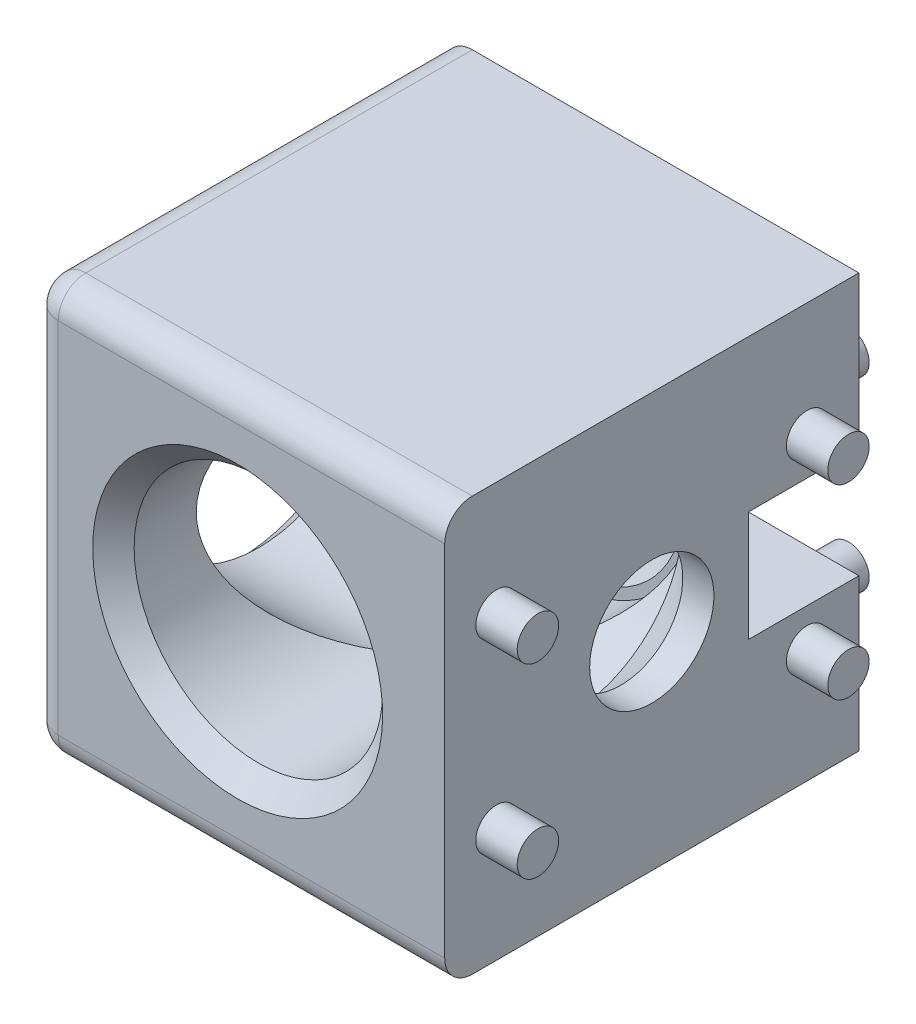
ISO-10303-21;
HEADER;
FILE_DESCRIPTION(('STEP AP214'),'2;1');
FILE_NAME('part.step','',(''),(''),'','','');
FILE_SCHEMA(('AUTOMOTIVE_DESIGN { 1 0 10303 214 1 1 1 1 }'));
ENDSEC;
DATA;
#1=APPLICATION_CONTEXT('core data for automotive mechanical design processes');
#2=APPLICATION_PROTOCOL_DEFINITION('international standard','automotive_design',2000,#1);
#3=PRODUCT_CONTEXT('',#1,'mechanical');
#4=PRODUCT('Part','Part','',(#3));
#5=PRODUCT_RELATED_PRODUCT_CATEGORY('part','',(#4));
#6=PRODUCT_DEFINITION_FORMATION('','',#4);
#7=PRODUCT_DEFINITION_CONTEXT('part definition',#1,'design');
#8=PRODUCT_DEFINITION('design','',#6,#7);
#9=PRODUCT_DEFINITION_SHAPE('','',#8);
#10=(LENGTH_UNIT() NAMED_UNIT(*) SI_UNIT(.MILLI.,.METRE.));
#11=(NAMED_UNIT(*) PLANE_ANGLE_UNIT() SI_UNIT($,.RADIAN.));
#12=(NAMED_UNIT(*) SI_UNIT($,.STERADIAN.) SOLID_ANGLE_UNIT());
#13=UNCERTAINTY_MEASURE_WITH_UNIT(LENGTH_MEASURE(1.E-05),#10,'distance_accuracy_value','');
#14=(GEOMETRIC_REPRESENTATION_CONTEXT(3) GLOBAL_UNCERTAINTY_ASSIGNED_CONTEXT((#13)) GLOBAL_UNIT_ASSIGNED_CONTEXT((#10,
#11,#12)) REPRESENTATION_CONTEXT('',''));
#15=CARTESIAN_POINT('',(0.,0.,0.));
#16=DIRECTION('',(0.,0.,1.));
#17=DIRECTION('',(1.,0.,0.));
#18=AXIS2_PLACEMENT_3D('',#15,#16,#17);
#19=CARTESIAN_POINT('',(0.,0.,6.));
#20=DIRECTION('',(0.,0.,1.));
#21=DIRECTION('',(1.,0.,0.));
#22=AXIS2_PLACEMENT_3D('',#19,#20,#21);
#23=CYLINDRICAL_SURFACE('',#22,9.);
#24=CARTESIAN_POINT('',(0.,0.,6.));
#25=DIRECTION('',(0.,0.,1.));
#26=DIRECTION('',(1.,0.,0.));
#27=AXIS2_PLACEMENT_3D('',#24,#25,#26);
#28=CIRCLE('',#27,9.);
#29=CARTESIAN_POINT('',(-9.,0.,6.));
#30=VERTEX_POINT('',#29);
#31=CARTESIAN_POINT('',(9.,0.,6.));
#32=VERTEX_POINT('',#31);
#33=EDGE_CURVE('E155',#30,#32,#28,.T.);
#34=ORIENTED_EDGE('',*,*,#33,.F.);
#35=CARTESIAN_POINT('',(0.,0.,15.));
#36=DIRECTION('',(-0.707106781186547,0.,0.707106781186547));
#37=DIRECTION('',(0.707106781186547,0.,0.707106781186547));
#38=AXIS2_PLACEMENT_3D('',#35,#36,#37);
#39=ELLIPSE('',#38,12.7279220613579,9.);
#40=CARTESIAN_POINT('',(0.,-9.,15.));
#41=VERTEX_POINT('',#40);
#42=EDGE_CURVE('E127',#30,#41,#39,.T.);
#43=ORIENTED_EDGE('',*,*,#42,.T.);
#44=CARTESIAN_POINT('',(0.,0.,15.));
#45=DIRECTION('',(0.707106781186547,0.,0.707106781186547));
#46=DIRECTION('',(-0.707106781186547,0.,0.707106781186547));
#47=AXIS2_PLACEMENT_3D('',#44,#45,#46);
#48=ELLIPSE('',#47,12.7279220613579,9.);
#49=EDGE_CURVE('E21',#41,#32,#48,.T.);
#50=ORIENTED_EDGE('',*,*,#49,.T.);
#51=EDGE_LOOP('',(#34,#43,#50));
#52=FACE_BOUND('',#51,.T.);
#53=ADVANCED_FACE('F16',(#52),#23,.F.);
#54=CARTESIAN_POINT('',(0.,0.,6.));
#55=DIRECTION('',(0.,0.,1.));
#56=DIRECTION('',(1.,0.,0.));
#57=AXIS2_PLACEMENT_3D('',#54,#55,#56);
#58=CYLINDRICAL_SURFACE('',#57,9.);
#59=CARTESIAN_POINT('',(0.,0.,15.));
#60=DIRECTION('',(0.707106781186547,0.,0.707106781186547));
#61=DIRECTION('',(-0.707106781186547,0.,0.707106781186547));
#62=AXIS2_PLACEMENT_3D('',#59,#60,#61);
#63=ELLIPSE('',#62,12.7279220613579,9.);
#64=CARTESIAN_POINT('',(0.,9.,15.));
#65=VERTEX_POINT('',#64);
#66=EDGE_CURVE('E149',#32,#65,#63,.T.);
#67=ORIENTED_EDGE('',*,*,#66,.T.);
#68=CARTESIAN_POINT('',(0.,0.,15.));
#69=DIRECTION('',(-0.707106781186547,0.,0.707106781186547));
#70=DIRECTION('',(0.707106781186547,0.,0.707106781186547));
#71=AXIS2_PLACEMENT_3D('',#68,#69,#70);
#72=ELLIPSE('',#71,12.7279220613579,9.);
#73=EDGE_CURVE('E130',#65,#30,#72,.T.);
#74=ORIENTED_EDGE('',*,*,#73,.T.);
#75=CARTESIAN_POINT('',(0.,0.,6.));
#76=DIRECTION('',(0.,0.,1.));
#77=DIRECTION('',(1.,0.,0.));
#78=AXIS2_PLACEMENT_3D('',#75,#76,#77);
#79=CIRCLE('',#78,9.);
#80=EDGE_CURVE('E156',#32,#30,#79,.T.);
#81=ORIENTED_EDGE('',*,*,#80,.F.);
#82=EDGE_LOOP('',(#67,#74,#81));
#83=FACE_BOUND('',#82,.T.);
#84=ADVANCED_FACE('F165',(#83),#58,.F.);
#85=CARTESIAN_POINT('',(9.,0.,15.));
#86=DIRECTION('',(-1.,0.,0.));
#87=DIRECTION('',(0.,0.,1.));
#88=AXIS2_PLACEMENT_3D('',#85,#86,#87);
#89=CYLINDRICAL_SURFACE('',#88,9.);
#90=ORIENTED_EDGE('',*,*,#49,.F.);
#91=CARTESIAN_POINT('',(0.,0.,15.));
#92=DIRECTION('',(-0.707106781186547,0.,0.707106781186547));
#93=DIRECTION('',(-0.707106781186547,0.,-0.707106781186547));
#94=AXIS2_PLACEMENT_3D('',#91,#92,#93);
#95=ELLIPSE('',#94,12.7279220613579,9.);
#96=CARTESIAN_POINT('',(9.,0.,24.));
#97=VERTEX_POINT('',#96);
#98=EDGE_CURVE('E144',#41,#97,#95,.T.);
#99=ORIENTED_EDGE('',*,*,#98,.T.);
#100=CARTESIAN_POINT('',(9.,0.,15.));
#101=DIRECTION('',(-1.,0.,0.));
#102=DIRECTION('',(0.,0.,1.));
#103=AXIS2_PLACEMENT_3D('',#100,#101,#102);
#104=CIRCLE('',#103,9.);
#105=EDGE_CURVE('E146',#32,#97,#104,.T.);
#106=ORIENTED_EDGE('',*,*,#105,.F.);
#107=EDGE_LOOP('',(#90,#99,#106));
#108=FACE_BOUND('',#107,.T.);
#109=ADVANCED_FACE('F143',(#108),#89,.F.);
#110=CARTESIAN_POINT('',(9.,0.,15.));
#111=DIRECTION('',(-1.,0.,0.));
#112=DIRECTION('',(0.,0.,1.));
#113=AXIS2_PLACEMENT_3D('',#110,#111,#112);
#114=CYLINDRICAL_SURFACE('',#113,9.);
#115=CARTESIAN_POINT('',(9.,0.,15.));
#116=DIRECTION('',(-1.,0.,0.));
#117=DIRECTION('',(0.,0.,1.));
#118=AXIS2_PLACEMENT_3D('',#115,#116,#117);
#119=CIRCLE('',#118,9.);
#120=EDGE_CURVE('E152',#97,#32,#119,.T.);
#121=ORIENTED_EDGE('',*,*,#120,.F.);
#122=CARTESIAN_POINT('',(0.,0.,15.));
#123=DIRECTION('',(-0.707106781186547,0.,0.707106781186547));
#124=DIRECTION('',(-0.707106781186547,0.,-0.707106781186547));
#125=AXIS2_PLACEMENT_3D('',#122,#123,#124);
#126=ELLIPSE('',#125,12.7279220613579,9.);
#127=EDGE_CURVE('E137',#97,#65,#126,.T.);
#128=ORIENTED_EDGE('',*,*,#127,.T.);
#129=ORIENTED_EDGE('',*,*,#66,.F.);
#130=EDGE_LOOP('',(#121,#128,#129));
#131=FACE_BOUND('',#130,.T.);
#132=ADVANCED_FACE('F167',(#131),#114,.F.);
#133=CARTESIAN_POINT('',(0.,0.,6.));
#134=DIRECTION('',(0.,0.,1.));
#135=DIRECTION('',(1.,0.,0.));
#136=AXIS2_PLACEMENT_3D('',#133,#134,#135);
#137=PLANE('',#136);
#138=ORIENTED_EDGE('',*,*,#33,.T.);
#139=ORIENTED_EDGE('',*,*,#80,.T.);
#140=EDGE_LOOP('',(#138,#139));
#141=FACE_BOUND('',#140,.T.);
#142=CARTESIAN_POINT('',(0.,0.,6.00000000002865));
#143=DIRECTION('',(0.,0.,1.));
#144=DIRECTION('',(1.,0.,0.));
#145=AXIS2_PLACEMENT_3D('',#142,#143,#144);
#146=CIRCLE('',#145,8.25000000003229);
#147=CARTESIAN_POINT('',(8.25000000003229,0.,6.00000000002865));
#148=VERTEX_POINT('',#147);
#149=EDGE_CURVE('E136',#148,#148,#146,.F.);
#150=ORIENTED_EDGE('',*,*,#149,.T.);
#151=EDGE_LOOP('',(#150));
#152=FACE_BOUND('',#151,.T.);
#153=ADVANCED_FACE('F193',(#141,#152),#137,.T.);
#154=CARTESIAN_POINT('',(9.,0.,15.));
#155=DIRECTION('',(-1.,0.,0.));
#156=DIRECTION('',(0.,0.,1.));
#157=AXIS2_PLACEMENT_3D('',#154,#155,#156);
#158=CYLINDRICAL_SURFACE('',#157,9.);
#159=CARTESIAN_POINT('',(0.,0.,15.));
#160=DIRECTION('',(-0.707106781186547,0.,-0.707106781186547));
#161=DIRECTION('',(-0.707106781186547,0.,0.707106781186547));
#162=AXIS2_PLACEMENT_3D('',#159,#160,#161);
#163=ELLIPSE('',#162,12.7279220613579,9.);
#164=EDGE_CURVE('E122',#65,#41,#163,.F.);
#165=ORIENTED_EDGE('',*,*,#164,.T.);
#166=ORIENTED_EDGE('',*,*,#42,.F.);
#167=ORIENTED_EDGE('',*,*,#73,.F.);
#168=EDGE_LOOP('',(#165,#166,#167));
#169=FACE_BOUND('',#168,.T.);
#170=CARTESIAN_POINT('',(-13.5,0.,15.));
#171=DIRECTION('',(-1.,0.,0.));
#172=DIRECTION('',(0.,0.,1.));
#173=AXIS2_PLACEMENT_3D('',#170,#171,#172);
#174=CIRCLE('',#173,9.);
#175=CARTESIAN_POINT('',(-13.5,0.,24.));
#176=VERTEX_POINT('',#175);
#177=EDGE_CURVE('E181',#176,#176,#174,.T.);
#178=ORIENTED_EDGE('',*,*,#177,.T.);
#179=EDGE_LOOP('',(#178));
#180=FACE_BOUND('',#179,.T.);
#181=ADVANCED_FACE('F124',(#169,#180),#158,.F.);
#182=CARTESIAN_POINT('',(9.,0.,15.));
#183=DIRECTION('',(-1.,0.,0.));
#184=DIRECTION('',(0.,0.,1.));
#185=AXIS2_PLACEMENT_3D('',#182,#183,#184);
#186=PLANE('',#185);
#187=ORIENTED_EDGE('',*,*,#105,.T.);
#188=ORIENTED_EDGE('',*,*,#120,.T.);
#189=EDGE_LOOP('',(#187,#188));
#190=FACE_BOUND('',#189,.T.);
#191=CARTESIAN_POINT('',(8.99999999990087,0.,15.));
#192=DIRECTION('',(-1.,0.,0.));
#193=DIRECTION('',(0.,0.,1.));
#194=AXIS2_PLACEMENT_3D('',#191,#192,#193);
#195=CIRCLE('',#194,8.25000000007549);
#196=CARTESIAN_POINT('',(8.99999999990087,0.,23.2500000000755));
#197=VERTEX_POINT('',#196);
#198=EDGE_CURVE('E178',#197,#197,#195,.F.);
#199=ORIENTED_EDGE('',*,*,#198,.T.);
#200=EDGE_LOOP('',(#199));
#201=FACE_BOUND('',#200,.T.);
#202=ADVANCED_FACE('F172',(#190,#201),#186,.T.);
#203=CARTESIAN_POINT('',(0.,0.,6.));
#204=DIRECTION('',(0.,0.,1.));
#205=DIRECTION('',(1.,0.,0.));
#206=AXIS2_PLACEMENT_3D('',#203,#204,#205);
#207=CYLINDRICAL_SURFACE('',#206,9.);
#208=ORIENTED_EDGE('',*,*,#127,.F.);
#209=ORIENTED_EDGE('',*,*,#98,.F.);
#210=ORIENTED_EDGE('',*,*,#164,.F.);
#211=EDGE_LOOP('',(#208,#209,#210));
#212=FACE_BOUND('',#211,.T.);
#213=CARTESIAN_POINT('',(0.,0.,28.5));
#214=DIRECTION('',(0.,0.,1.));
#215=DIRECTION('',(1.,0.,0.));
#216=AXIS2_PLACEMENT_3D('',#213,#214,#215);
#217=CIRCLE('',#216,9.);
#218=CARTESIAN_POINT('',(9.,0.,28.5));
#219=VERTEX_POINT('',#218);
#220=EDGE_CURVE('E183',#219,#219,#217,.T.);
#221=ORIENTED_EDGE('',*,*,#220,.T.);
#222=EDGE_LOOP('',(#221));
#223=FACE_BOUND('',#222,.T.);
#224=ADVANCED_FACE('F150',(#212,#223),#207,.F.);
#225=CARTESIAN_POINT('',(0.,0.,6.00000000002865));
#226=DIRECTION('',(0.,0.,1.));
#227=DIRECTION('',(1.,0.,0.));
#228=AXIS2_PLACEMENT_3D('',#225,#226,#227);
#229=CONICAL_SURFACE('',#228,8.25000000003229,0.785398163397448);
#230=ORIENTED_EDGE('',*,*,#149,.F.);
#231=EDGE_LOOP('',(#230));
#232=FACE_BOUND('',#231,.T.);
#233=CARTESIAN_POINT('',(0.,0.,2.25));
#234=DIRECTION('',(0.,0.,1.));
#235=DIRECTION('',(1.,0.,0.));
#236=AXIS2_PLACEMENT_3D('',#233,#234,#235);
#237=CIRCLE('',#236,4.5);
#238=CARTESIAN_POINT('',(4.5,0.,2.25));
#239=VERTEX_POINT('',#238);
#240=EDGE_CURVE('E202',#239,#239,#237,.F.);
#241=ORIENTED_EDGE('',*,*,#240,.T.);
#242=EDGE_LOOP('',(#241));
#243=FACE_BOUND('',#242,.T.);
#244=ADVANCED_FACE('F195',(#232,#243),#229,.F.);
#245=CARTESIAN_POINT('',(-15.,0.,15.));
#246=DIRECTION('',(-1.,0.,0.));
#247=DIRECTION('',(0.,-1.,0.));
#248=AXIS2_PLACEMENT_3D('',#245,#246,#247);
#249=CONICAL_SURFACE('',#248,10.5,0.785398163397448);
#250=ORIENTED_EDGE('',*,*,#177,.F.);
#251=EDGE_LOOP('',(#250));
#252=FACE_BOUND('',#251,.T.);
#253=CARTESIAN_POINT('',(-15.,0.,15.));
#254=DIRECTION('',(-1.,0.,0.));
#255=DIRECTION('',(0.,-1.,0.));
#256=AXIS2_PLACEMENT_3D('',#253,#254,#255);
#257=CIRCLE('',#256,10.5);
#258=CARTESIAN_POINT('',(-15.,-10.5,15.));
#259=VERTEX_POINT('',#258);
#260=EDGE_CURVE('E207',#259,#259,#257,.F.);
#261=ORIENTED_EDGE('',*,*,#260,.F.);
#262=EDGE_LOOP('',(#261));
#263=FACE_BOUND('',#262,.T.);
#264=ADVANCED_FACE('F198',(#252,#263),#249,.F.);
#265=CARTESIAN_POINT('',(-14.9988557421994,-12.943026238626,28.0364652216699));
#266=CARTESIAN_POINT('',(-14.9988588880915,-12.9615835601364,28.0652869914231));
#267=CARTESIAN_POINT('',(-14.997983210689,-12.9802040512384,28.0940546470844));
#268=CARTESIAN_POINT('',(-14.9962292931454,-12.9988753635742,28.1227491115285));
#269=CARTESIAN_POINT('',(-15.0014071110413,-13.0064153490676,27.995650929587));
#270=CARTESIAN_POINT('',(-15.001410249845,-13.024930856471,28.0244077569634));
#271=CARTESIAN_POINT('',(-15.0005365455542,-13.0435093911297,28.0531105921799));
#272=CARTESIAN_POINT('',(-14.9987865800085,-13.0621386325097,28.0817404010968));
#273=CARTESIAN_POINT('',(-14.9996935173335,-13.0698245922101,27.9548241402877));
#274=CARTESIAN_POINT('',(-14.9996966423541,-13.0882587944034,27.9834546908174));
#275=CARTESIAN_POINT('',(-14.9988267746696,-13.106755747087,28.0120314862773));
#276=CARTESIAN_POINT('',(-14.9970844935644,-13.1253031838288,28.0405355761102));
#277=CARTESIAN_POINT('',(-14.993720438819,-13.1330512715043,27.9141153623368));
#278=CARTESIAN_POINT('',(-14.9937235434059,-13.151364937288,27.9425587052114));
#279=CARTESIAN_POINT('',(-14.9928593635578,-13.169740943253,27.9709486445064));
#280=CARTESIAN_POINT('',(-14.9911284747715,-13.1881671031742,27.9992663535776));
#281=(BOUNDED_SURFACE() B_SPLINE_SURFACE(3,3,((#265,#266,#267,#268),(#269,#270,#271,#272),(#273,
#274,#275,#276),(#277,#278,#279,#280)),.UNSPECIFIED.,.F.,.F.,
.F.) B_SPLINE_SURFACE_WITH_KNOTS((4,4),(4,4),(0.,1.),(0.00418252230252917,1.),
.UNSPECIFIED.) GEOMETRIC_REPRESENTATION_ITEM() RATIONAL_B_SPLINE_SURFACE(((0.999997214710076,
0.99977709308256,0.999778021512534,1.),(0.998931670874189,0.998711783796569,0.998712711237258,
0.998934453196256),(0.998931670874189,0.998711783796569,0.998712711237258,0.998934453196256),
(0.999997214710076,0.99977709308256,0.999778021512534,1.))) REPRESENTATION_ITEM('') SURFACE());
#282=CARTESIAN_POINT('',(-13.,-13.,28.));
#283=DIRECTION('',(0.,1.,0.));
#284=DIRECTION('',(0.,0.,1.));
#285=AXIS2_PLACEMENT_3D('',#282,#283,#284);
#286=CIRCLE('',#285,2.);
#287=CARTESIAN_POINT('',(-15.,-13.,28.));
#288=VERTEX_POINT('',#287);
#289=CARTESIAN_POINT('',(-14.9962743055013,-13.,28.1220200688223));
#290=VERTEX_POINT('',#289);
#291=EDGE_CURVE('E325',#288,#290,#286,.T.);
#292=CARTESIAN_POINT('',(-13.,-13.,28.));
#293=DIRECTION('',(0.,0.,1.));
#294=DIRECTION('',(1.,0.,0.));
#295=AXIS2_PLACEMENT_3D('',#292,#293,#294);
#296=CIRCLE('',#295,2.);
#297=CARTESIAN_POINT('',(-14.9912339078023,-13.1870495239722,28.));
#298=VERTEX_POINT('',#297);
#299=EDGE_CURVE('E317',#298,#288,#296,.F.);
#300=CARTESIAN_POINT('',(-13.0000000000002,-13.,27.9999999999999));
#301=DIRECTION('',(0.0511655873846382,-0.544682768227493,0.837079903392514));
#302=DIRECTION('',(-0.781321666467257,0.500221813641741,0.373248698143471));
#303=AXIS2_PLACEMENT_3D('',#300,#301,#302);
#304=CIRCLE('',#303,1.99999999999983);
#305=EDGE_CURVE('E180',#290,#298,#304,.T.);
#306=ORIENTED_EDGE('',*,*,#291,.F.);
#307=ORIENTED_EDGE('',*,*,#299,.F.);
#308=ORIENTED_EDGE('',*,*,#305,.F.);
#309=EDGE_LOOP('',(#306,#307,#308));
#310=FACE_BOUND('',#309,.T.);
#311=ADVANCED_FACE('F572',(#310),#281,.T.);
#312=CARTESIAN_POINT('',(11.25,-6.75,-3.));
#313=DIRECTION('',(0.,0.,1.));
#314=DIRECTION('',(1.,0.,0.));
#315=AXIS2_PLACEMENT_3D('',#312,#313,#314);
#316=PLANE('',#315);
#317=CARTESIAN_POINT('',(11.25,-6.75,-3.));
#318=DIRECTION('',(0.,0.,1.));
#319=DIRECTION('',(1.,0.,0.));
#320=AXIS2_PLACEMENT_3D('',#317,#318,#319);
#321=CIRCLE('',#320,1.5);
#322=CARTESIAN_POINT('',(12.75,-6.75,-3.));
#323=VERTEX_POINT('',#322);
#324=EDGE_CURVE('E313',#323,#323,#321,.T.);
#325=ORIENTED_EDGE('',*,*,#324,.F.);
#326=EDGE_LOOP('',(#325));
#327=FACE_BOUND('',#326,.T.);
#328=ADVANCED_FACE('F568',(#327),#316,.F.);
#329=CARTESIAN_POINT('',(-11.25,-6.75,-3.));
#330=DIRECTION('',(0.,0.,1.));
#331=DIRECTION('',(1.,0.,0.));
#332=AXIS2_PLACEMENT_3D('',#329,#330,#331);
#333=PLANE('',#332);
#334=CARTESIAN_POINT('',(-11.25,-6.75,-3.));
#335=DIRECTION('',(0.,0.,1.));
#336=DIRECTION('',(1.,0.,0.));
#337=AXIS2_PLACEMENT_3D('',#334,#335,#336);
#338=CIRCLE('',#337,1.5);
#339=CARTESIAN_POINT('',(-9.75,-6.75,-3.));
#340=VERTEX_POINT('',#339);
#341=EDGE_CURVE('E310',#340,#340,#338,.T.);
#342=ORIENTED_EDGE('',*,*,#341,.F.);
#343=EDGE_LOOP('',(#342));
#344=FACE_BOUND('',#343,.T.);
#345=ADVANCED_FACE('F564',(#344),#333,.F.);
#346=CARTESIAN_POINT('',(-11.25,6.74999999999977,-3.));
#347=DIRECTION('',(0.,0.,1.));
#348=DIRECTION('',(1.,0.,0.));
#349=AXIS2_PLACEMENT_3D('',#346,#347,#348);
#350=PLANE('',#349);
#351=CARTESIAN_POINT('',(-11.25,6.74999999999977,-3.));
#352=DIRECTION('',(0.,0.,1.));
#353=DIRECTION('',(1.,0.,0.));
#354=AXIS2_PLACEMENT_3D('',#351,#352,#353);
#355=CIRCLE('',#354,1.5);
#356=CARTESIAN_POINT('',(-9.75,6.74999999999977,-3.));
#357=VERTEX_POINT('',#356);
#358=EDGE_CURVE('E307',#357,#357,#355,.T.);
#359=ORIENTED_EDGE('',*,*,#358,.F.);
#360=EDGE_LOOP('',(#359));
#361=FACE_BOUND('',#360,.T.);
#362=ADVANCED_FACE('F560',(#361),#350,.F.);
#363=CARTESIAN_POINT('',(11.25,6.74999999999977,-3.));
#364=DIRECTION('',(0.,0.,1.));
#365=DIRECTION('',(1.,0.,0.));
#366=AXIS2_PLACEMENT_3D('',#363,#364,#365);
#367=PLANE('',#366);
#368=CARTESIAN_POINT('',(11.25,6.74999999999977,-3.));
#369=DIRECTION('',(0.,0.,1.));
#370=DIRECTION('',(1.,0.,0.));
#371=AXIS2_PLACEMENT_3D('',#368,#369,#370);
#372=CIRCLE('',#371,1.5);
#373=CARTESIAN_POINT('',(12.75,6.74999999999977,-3.));
#374=VERTEX_POINT('',#373);
#375=EDGE_CURVE('E304',#374,#374,#372,.T.);
#376=ORIENTED_EDGE('',*,*,#375,.F.);
#377=EDGE_LOOP('',(#376));
#378=FACE_BOUND('',#377,.T.);
#379=ADVANCED_FACE('F557',(#378),#367,.F.);
#380=CARTESIAN_POINT('',(8.99999999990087,0.,15.));
#381=DIRECTION('',(-1.,0.,0.));
#382=DIRECTION('',(0.,0.,1.));
#383=AXIS2_PLACEMENT_3D('',#380,#381,#382);
#384=CONICAL_SURFACE('',#383,8.25000000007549,0.785398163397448);
#385=ORIENTED_EDGE('',*,*,#198,.F.);
#386=EDGE_LOOP('',(#385));
#387=FACE_BOUND('',#386,.T.);
#388=CARTESIAN_POINT('',(12.75,0.,15.));
#389=DIRECTION('',(-1.,0.,0.));
#390=DIRECTION('',(0.,0.,1.));
#391=AXIS2_PLACEMENT_3D('',#388,#389,#390);
#392=CIRCLE('',#391,4.5);
#393=CARTESIAN_POINT('',(12.75,0.,19.5));
#394=VERTEX_POINT('',#393);
#395=EDGE_CURVE('E214',#394,#394,#392,.F.);
#396=ORIENTED_EDGE('',*,*,#395,.T.);
#397=EDGE_LOOP('',(#396));
#398=FACE_BOUND('',#397,.T.);
#399=ADVANCED_FACE('F554',(#387,#398),#384,.F.);
#400=CARTESIAN_POINT('',(-13.0000000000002,-13.,27.9999999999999));
#401=DIRECTION('',(0.0933609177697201,0.837115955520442,0.538999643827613));
#402=DIRECTION('',(-0.99431676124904,0.0505723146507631,0.0936836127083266));
#403=AXIS2_PLACEMENT_3D('',#400,#401,#402);
#404=SPHERICAL_SURFACE('',#403,1.99999999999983);
#405=CARTESIAN_POINT('',(-13.,-13.,28.));
#406=DIRECTION('',(0.,0.,1.));
#407=DIRECTION('',(1.,0.,0.));
#408=AXIS2_PLACEMENT_3D('',#405,#406,#407);
#409=CIRCLE('',#408,2.);
#410=CARTESIAN_POINT('',(-13.,-15.,28.));
#411=VERTEX_POINT('',#410);
#412=EDGE_CURVE('E320',#411,#298,#409,.F.);
#413=ORIENTED_EDGE('',*,*,#412,.F.);
#414=CARTESIAN_POINT('',(-13.,-13.,28.));
#415=DIRECTION('',(1.,0.,0.));
#416=DIRECTION('',(0.,0.,-1.));
#417=AXIS2_PLACEMENT_3D('',#414,#415,#416);
#418=CIRCLE('',#417,2.);
#419=CARTESIAN_POINT('',(-13.,-13.,30.));
#420=VERTEX_POINT('',#419);
#421=EDGE_CURVE('E300',#420,#411,#418,.T.);
#422=ORIENTED_EDGE('',*,*,#421,.F.);
#423=CARTESIAN_POINT('',(-13.,-13.,28.));
#424=DIRECTION('',(0.,1.,0.));
#425=DIRECTION('',(0.,0.,1.));
#426=AXIS2_PLACEMENT_3D('',#423,#424,#425);
#427=CIRCLE('',#426,2.);
#428=EDGE_CURVE('E188',#290,#420,#427,.T.);
#429=ORIENTED_EDGE('',*,*,#428,.F.);
#430=ORIENTED_EDGE('',*,*,#305,.T.);
#431=EDGE_LOOP('',(#413,#422,#429,#430));
#432=FACE_BOUND('',#431,.T.);
#433=ADVANCED_FACE('F337',(#432),#404,.T.);
#434=CARTESIAN_POINT('',(0.,0.,30.));
#435=DIRECTION('',(0.,0.,1.));
#436=DIRECTION('',(0.,-1.,0.));
#437=AXIS2_PLACEMENT_3D('',#434,#435,#436);
#438=CONICAL_SURFACE('',#437,10.5,0.785398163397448);
#439=ORIENTED_EDGE('',*,*,#220,.F.);
#440=EDGE_LOOP('',(#439));
#441=FACE_BOUND('',#440,.T.);
#442=CARTESIAN_POINT('',(0.,0.,30.));
#443=DIRECTION('',(0.,0.,1.));
#444=DIRECTION('',(0.,-1.,0.));
#445=AXIS2_PLACEMENT_3D('',#442,#443,#444);
#446=CIRCLE('',#445,10.5);
#447=CARTESIAN_POINT('',(0.,-10.5,30.));
#448=VERTEX_POINT('',#447);
#449=EDGE_CURVE('E295',#448,#448,#446,.T.);
#450=ORIENTED_EDGE('',*,*,#449,.T.);
#451=EDGE_LOOP('',(#450));
#452=FACE_BOUND('',#451,.T.);
#453=ADVANCED_FACE('F550',(#441,#452),#438,.F.);
#454=CARTESIAN_POINT('',(-13.,0.,28.));
#455=DIRECTION('',(0.,1.,0.));
#456=DIRECTION('',(0.,0.,1.));
#457=AXIS2_PLACEMENT_3D('',#454,#455,#456);
#458=CYLINDRICAL_SURFACE('',#457,2.);
#459=DIRECTION('',(0.,1.,0.));
#460=VECTOR('',#459,1.);
#461=CARTESIAN_POINT('',(-15.,0.,28.));
#462=LINE('',#461,#460);
#463=CARTESIAN_POINT('',(-15.,12.9999999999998,28.));
#464=VERTEX_POINT('',#463);
#465=EDGE_CURVE('E204',#288,#464,#462,.T.);
#466=ORIENTED_EDGE('',*,*,#465,.F.);
#467=ORIENTED_EDGE('',*,*,#291,.T.);
#468=ORIENTED_EDGE('',*,*,#428,.T.);
#469=DIRECTION('',(0.,1.,0.));
#470=VECTOR('',#469,1.);
#471=CARTESIAN_POINT('',(-13.,0.,30.));
#472=LINE('',#471,#470);
#473=CARTESIAN_POINT('',(-13.,12.9999999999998,30.));
#474=VERTEX_POINT('',#473);
#475=EDGE_CURVE('E334',#420,#474,#472,.T.);
#476=ORIENTED_EDGE('',*,*,#475,.T.);
#477=CARTESIAN_POINT('',(-13.,12.9999999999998,28.));
#478=DIRECTION('',(0.,1.,0.));
#479=DIRECTION('',(0.,0.,1.));
#480=AXIS2_PLACEMENT_3D('',#477,#478,#479);
#481=CIRCLE('',#480,2.);
#482=CARTESIAN_POINT('',(-14.9962743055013,12.9999999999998,28.1220200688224));
#483=VERTEX_POINT('',#482);
#484=EDGE_CURVE('E210',#483,#474,#481,.T.);
#485=ORIENTED_EDGE('',*,*,#484,.F.);
#486=CARTESIAN_POINT('',(-15.,12.9999999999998,28.));
#487=CARTESIAN_POINT('',(-15.0000000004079,13.0000139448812,28.0050830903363));
#488=CARTESIAN_POINT('',(-14.9999806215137,13.0000259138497,28.0101661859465));
#489=CARTESIAN_POINT('',(-14.9999030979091,13.0000460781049,28.0203334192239));
#490=CARTESIAN_POINT('',(-14.9998449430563,13.0000542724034,28.0254175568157));
#491=CARTESIAN_POINT('',(-14.9996898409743,13.0000670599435,28.0355865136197));
#492=CARTESIAN_POINT('',(-14.9995928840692,13.000071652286,28.0406713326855));
#493=CARTESIAN_POINT('',(-14.9993601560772,13.0000774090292,28.0508412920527));
#494=CARTESIAN_POINT('',(-14.9992243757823,13.0000785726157,28.055926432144));
#495=CARTESIAN_POINT('',(-14.9989139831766,13.0000776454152,28.0660966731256));
#496=CARTESIAN_POINT('',(-14.9987393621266,13.000075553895,28.071181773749));
#497=CARTESIAN_POINT('',(-14.9983512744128,13.0000682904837,28.0813515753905));
#498=CARTESIAN_POINT('',(-14.9981377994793,13.0000631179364,28.0864362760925));
#499=CARTESIAN_POINT('',(-14.9976719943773,13.000049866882,28.0966049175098));
#500=CARTESIAN_POINT('',(-14.9974196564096,13.0000417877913,28.1016888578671));
#501=CARTESIAN_POINT('',(-14.9968761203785,13.0000228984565,28.1118556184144));
#502=CARTESIAN_POINT('',(-14.996584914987,13.000012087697,28.1169384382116));
#503=CARTESIAN_POINT('',(-14.9962743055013,12.9999999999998,28.1220200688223));
#504=B_SPLINE_CURVE_WITH_KNOTS('',3,(#486,#487,#488,#489,#490,#491,#492,#493,#494,#495,#496,
#497,#498,#499,#500,#501,#502,#503),.UNSPECIFIED.,.F.,.F.,(4,2,2,2,2,2,2,2,4),(0.,
0.0152492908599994,0.0305025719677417,0.0457596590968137,0.0610203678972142,0.0762845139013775,
0.0915519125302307,0.106822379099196,0.122095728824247),.UNSPECIFIED.);
#505=EDGE_CURVE('E205',#464,#483,#504,.T.);
#506=ORIENTED_EDGE('',*,*,#505,.F.);
#507=EDGE_LOOP('',(#466,#467,#468,#476,#485,#506));
#508=FACE_BOUND('',#507,.T.);
#509=ADVANCED_FACE('F332',(#508),#458,.T.);
#510=CARTESIAN_POINT('',(18.,-6.75,26.2499999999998));
#511=DIRECTION('',(-1.,0.,0.));
#512=DIRECTION('',(0.,-1.,0.));
#513=AXIS2_PLACEMENT_3D('',#510,#511,#512);
#514=PLANE('',#513);
#515=CARTESIAN_POINT('',(18.,-6.75,26.2499999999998));
#516=DIRECTION('',(-1.,0.,0.));
#517=DIRECTION('',(0.,-1.,0.));
#518=AXIS2_PLACEMENT_3D('',#515,#516,#517);
#519=CIRCLE('',#518,1.5);
#520=CARTESIAN_POINT('',(18.,-8.25,26.2499999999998));
#521=VERTEX_POINT('',#520);
#522=EDGE_CURVE('E291',#521,#521,#519,.T.);
#523=ORIENTED_EDGE('',*,*,#522,.F.);
#524=EDGE_LOOP('',(#523));
#525=FACE_BOUND('',#524,.T.);
#526=ADVANCED_FACE('F543',(#525),#514,.F.);
#527=CARTESIAN_POINT('',(18.,-6.75,3.74999999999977));
#528=DIRECTION('',(-1.,0.,0.));
#529=DIRECTION('',(0.,-1.,0.));
#530=AXIS2_PLACEMENT_3D('',#527,#528,#529);
#531=PLANE('',#530);
#532=CARTESIAN_POINT('',(18.,-6.75,3.74999999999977));
#533=DIRECTION('',(-1.,0.,0.));
#534=DIRECTION('',(0.,-1.,0.));
#535=AXIS2_PLACEMENT_3D('',#532,#533,#534);
#536=CIRCLE('',#535,1.5);
#537=CARTESIAN_POINT('',(18.,-8.25,3.74999999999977));
#538=VERTEX_POINT('',#537);
#539=EDGE_CURVE('E288',#538,#538,#536,.T.);
#540=ORIENTED_EDGE('',*,*,#539,.F.);
#541=EDGE_LOOP('',(#540));
#542=FACE_BOUND('',#541,.T.);
#543=ADVANCED_FACE('F539',(#542),#531,.F.);
#544=CARTESIAN_POINT('',(18.,6.74999999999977,3.74999999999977));
#545=DIRECTION('',(-1.,0.,0.));
#546=DIRECTION('',(0.,-1.,0.));
#547=AXIS2_PLACEMENT_3D('',#544,#545,#546);
#548=PLANE('',#547);
#549=CARTESIAN_POINT('',(18.,6.74999999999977,3.74999999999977));
#550=DIRECTION('',(-1.,0.,0.));
#551=DIRECTION('',(0.,-1.,0.));
#552=AXIS2_PLACEMENT_3D('',#549,#550,#551);
#553=CIRCLE('',#552,1.5);
#554=CARTESIAN_POINT('',(18.,5.24999999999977,3.74999999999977));
#555=VERTEX_POINT('',#554);
#556=EDGE_CURVE('E285',#555,#555,#553,.T.);
#557=ORIENTED_EDGE('',*,*,#556,.F.);
#558=EDGE_LOOP('',(#557));
#559=FACE_BOUND('',#558,.T.);
#560=ADVANCED_FACE('F463',(#559),#548,.F.);
#561=CARTESIAN_POINT('',(18.,6.74999999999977,26.2499999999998));
#562=DIRECTION('',(-1.,0.,0.));
#563=DIRECTION('',(0.,-1.,0.));
#564=AXIS2_PLACEMENT_3D('',#561,#562,#563);
#565=PLANE('',#564);
#566=CARTESIAN_POINT('',(18.,6.74999999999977,26.2499999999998));
#567=DIRECTION('',(-1.,0.,0.));
#568=DIRECTION('',(0.,-1.,0.));
#569=AXIS2_PLACEMENT_3D('',#566,#567,#568);
#570=CIRCLE('',#569,1.5);
#571=CARTESIAN_POINT('',(18.,5.24999999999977,26.2499999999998));
#572=VERTEX_POINT('',#571);
#573=EDGE_CURVE('E282',#572,#572,#570,.T.);
#574=ORIENTED_EDGE('',*,*,#573,.F.);
#575=EDGE_LOOP('',(#574));
#576=FACE_BOUND('',#575,.T.);
#577=ADVANCED_FACE('F456',(#576),#565,.F.);
#578=CARTESIAN_POINT('',(-13.,12.9999999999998,28.0000000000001));
#579=DIRECTION('',(0.093360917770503,0.837115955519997,0.538999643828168));
#580=DIRECTION('',(-0.13412603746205,0.54700396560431,-0.826315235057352));
#581=AXIS2_PLACEMENT_3D('',#578,#579,#580);
#582=SPHERICAL_SURFACE('',#581,2.00000000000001);
#583=CARTESIAN_POINT('',(-13.,12.9999999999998,28.));
#584=DIRECTION('',(0.,0.,-1.));
#585=DIRECTION('',(-1.,0.,0.));
#586=AXIS2_PLACEMENT_3D('',#583,#584,#585);
#587=CIRCLE('',#586,2.);
#588=CARTESIAN_POINT('',(-13.,14.9999999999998,28.));
#589=VERTEX_POINT('',#588);
#590=EDGE_CURVE('E275',#464,#589,#587,.T.);
#591=ORIENTED_EDGE('',*,*,#590,.F.);
#592=ORIENTED_EDGE('',*,*,#505,.T.);
#593=ORIENTED_EDGE('',*,*,#484,.T.);
#594=CARTESIAN_POINT('',(-13.,12.9999999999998,28.));
#595=DIRECTION('',(1.,0.,0.));
#596=DIRECTION('',(0.,0.,-1.));
#597=AXIS2_PLACEMENT_3D('',#594,#595,#596);
#598=CIRCLE('',#597,2.);
#599=EDGE_CURVE('E279',#589,#474,#598,.T.);
#600=ORIENTED_EDGE('',*,*,#599,.F.);
#601=EDGE_LOOP('',(#591,#592,#593,#600));
#602=FACE_BOUND('',#601,.T.);
#603=ADVANCED_FACE('F18',(#602),#582,.T.);
#604=CARTESIAN_POINT('',(0.,0.,0.));
#605=DIRECTION('',(0.,0.,1.));
#606=DIRECTION('',(1.,0.,0.));
#607=AXIS2_PLACEMENT_3D('',#604,#605,#606);
#608=CYLINDRICAL_SURFACE('',#607,4.5);
#609=ORIENTED_EDGE('',*,*,#240,.F.);
#610=EDGE_LOOP('',(#609));
#611=FACE_BOUND('',#610,.T.);
#612=CARTESIAN_POINT('',(0.,0.,0.));
#613=DIRECTION('',(0.,0.,1.));
#614=DIRECTION('',(1.,0.,0.));
#615=AXIS2_PLACEMENT_3D('',#612,#613,#614);
#616=CIRCLE('',#615,4.5);
#617=CARTESIAN_POINT('',(4.5,0.,0.));
#618=VERTEX_POINT('',#617);
#619=EDGE_CURVE('E270',#618,#618,#616,.F.);
#620=ORIENTED_EDGE('',*,*,#619,.T.);
#621=EDGE_LOOP('',(#620));
#622=FACE_BOUND('',#621,.T.);
#623=ADVANCED_FACE('F455',(#611,#622),#608,.F.);
#624=CARTESIAN_POINT('',(-15.,0.,15.));
#625=DIRECTION('',(-1.,0.,0.));
#626=DIRECTION('',(0.,0.,1.));
#627=AXIS2_PLACEMENT_3D('',#624,#625,#626);
#628=PLANE('',#627);
#629=ORIENTED_EDGE('',*,*,#260,.T.);
#630=EDGE_LOOP('',(#629));
#631=FACE_BOUND('',#630,.T.);
#632=DIRECTION('',(0.,0.,1.));
#633=VECTOR('',#632,1.);
#634=CARTESIAN_POINT('',(-15.,-13.,15.));
#635=LINE('',#634,#633);
#636=CARTESIAN_POINT('',(-15.,-13.,0.));
#637=VERTEX_POINT('',#636);
#638=EDGE_CURVE('E316',#288,#637,#635,.F.);
#639=ORIENTED_EDGE('',*,*,#638,.F.);
#640=ORIENTED_EDGE('',*,*,#465,.T.);
#641=DIRECTION('',(0.,0.,-1.));
#642=VECTOR('',#641,1.);
#643=CARTESIAN_POINT('',(-15.,12.9999999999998,15.));
#644=LINE('',#643,#642);
#645=CARTESIAN_POINT('',(-15.,12.9999999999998,0.));
#646=VERTEX_POINT('',#645);
#647=EDGE_CURVE('E274',#646,#464,#644,.F.);
#648=ORIENTED_EDGE('',*,*,#647,.F.);
#649=DIRECTION('',(0.,1.,0.));
#650=VECTOR('',#649,1.);
#651=CARTESIAN_POINT('',(-15.,0.,0.));
#652=LINE('',#651,#650);
#653=EDGE_CURVE('E265',#646,#637,#652,.F.);
#654=ORIENTED_EDGE('',*,*,#653,.T.);
#655=EDGE_LOOP('',(#639,#640,#648,#654));
#656=FACE_BOUND('',#655,.T.);
#657=ADVANCED_FACE('F451',(#631,#656),#628,.T.);
#658=CARTESIAN_POINT('',(-13.,-13.,15.));
#659=DIRECTION('',(0.,0.,1.));
#660=DIRECTION('',(1.,0.,0.));
#661=AXIS2_PLACEMENT_3D('',#658,#659,#660);
#662=CYLINDRICAL_SURFACE('',#661,2.);
#663=CARTESIAN_POINT('',(-13.,-13.,0.));
#664=DIRECTION('',(0.,0.,1.));
#665=DIRECTION('',(1.,0.,0.));
#666=AXIS2_PLACEMENT_3D('',#663,#664,#665);
#667=CIRCLE('',#666,2.);
#668=CARTESIAN_POINT('',(-13.,-15.,0.));
#669=VERTEX_POINT('',#668);
#670=EDGE_CURVE('E262',#637,#669,#667,.T.);
#671=ORIENTED_EDGE('',*,*,#670,.T.);
#672=DIRECTION('',(0.,0.,1.));
#673=VECTOR('',#672,1.);
#674=CARTESIAN_POINT('',(-13.,-15.,15.));
#675=LINE('',#674,#673);
#676=EDGE_CURVE('E303',#669,#411,#675,.T.);
#677=ORIENTED_EDGE('',*,*,#676,.T.);
#678=ORIENTED_EDGE('',*,*,#412,.T.);
#679=ORIENTED_EDGE('',*,*,#299,.T.);
#680=ORIENTED_EDGE('',*,*,#638,.T.);
#681=EDGE_LOOP('',(#671,#677,#678,#679,#680));
#682=FACE_BOUND('',#681,.T.);
#683=ADVANCED_FACE('F529',(#682),#662,.T.);
#684=CARTESIAN_POINT('',(11.25,-6.75,-3.));
#685=DIRECTION('',(0.,0.,1.));
#686=DIRECTION('',(1.,0.,0.));
#687=AXIS2_PLACEMENT_3D('',#684,#685,#686);
#688=CYLINDRICAL_SURFACE('',#687,1.5);
#689=ORIENTED_EDGE('',*,*,#324,.T.);
#690=EDGE_LOOP('',(#689));
#691=FACE_BOUND('',#690,.T.);
#692=CARTESIAN_POINT('',(11.25,-6.75,0.));
#693=DIRECTION('',(0.,0.,1.));
#694=DIRECTION('',(1.,0.,0.));
#695=AXIS2_PLACEMENT_3D('',#692,#693,#694);
#696=CIRCLE('',#695,1.5);
#697=CARTESIAN_POINT('',(12.75,-6.75,0.));
#698=VERTEX_POINT('',#697);
#699=EDGE_CURVE('E258',#698,#698,#696,.F.);
#700=ORIENTED_EDGE('',*,*,#699,.T.);
#701=EDGE_LOOP('',(#700));
#702=FACE_BOUND('',#701,.T.);
#703=ADVANCED_FACE('F525',(#691,#702),#688,.T.);
#704=CARTESIAN_POINT('',(-11.25,-6.75,-3.));
#705=DIRECTION('',(0.,0.,1.));
#706=DIRECTION('',(1.,0.,0.));
#707=AXIS2_PLACEMENT_3D('',#704,#705,#706);
#708=CYLINDRICAL_SURFACE('',#707,1.5);
#709=ORIENTED_EDGE('',*,*,#341,.T.);
#710=EDGE_LOOP('',(#709));
#711=FACE_BOUND('',#710,.T.);
#712=CARTESIAN_POINT('',(-11.25,-6.75,0.));
#713=DIRECTION('',(0.,0.,1.));
#714=DIRECTION('',(1.,0.,0.));
#715=AXIS2_PLACEMENT_3D('',#712,#713,#714);
#716=CIRCLE('',#715,1.5);
#717=CARTESIAN_POINT('',(-9.75,-6.75,0.));
#718=VERTEX_POINT('',#717);
#719=EDGE_CURVE('E255',#718,#718,#716,.F.);
#720=ORIENTED_EDGE('',*,*,#719,.T.);
#721=EDGE_LOOP('',(#720));
#722=FACE_BOUND('',#721,.T.);
#723=ADVANCED_FACE('F521',(#711,#722),#708,.T.);
#724=CARTESIAN_POINT('',(-11.25,6.74999999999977,-3.));
#725=DIRECTION('',(0.,0.,1.));
#726=DIRECTION('',(1.,0.,0.));
#727=AXIS2_PLACEMENT_3D('',#724,#725,#726);
#728=CYLINDRICAL_SURFACE('',#727,1.5);
#729=ORIENTED_EDGE('',*,*,#358,.T.);
#730=EDGE_LOOP('',(#729));
#731=FACE_BOUND('',#730,.T.);
#732=CARTESIAN_POINT('',(-11.25,6.74999999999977,0.));
#733=DIRECTION('',(0.,0.,1.));
#734=DIRECTION('',(1.,0.,0.));
#735=AXIS2_PLACEMENT_3D('',#732,#733,#734);
#736=CIRCLE('',#735,1.5);
#737=CARTESIAN_POINT('',(-9.75,6.74999999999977,0.));
#738=VERTEX_POINT('',#737);
#739=EDGE_CURVE('E252',#738,#738,#736,.F.);
#740=ORIENTED_EDGE('',*,*,#739,.T.);
#741=EDGE_LOOP('',(#740));
#742=FACE_BOUND('',#741,.T.);
#743=ADVANCED_FACE('F517',(#731,#742),#728,.T.);
#744=CARTESIAN_POINT('',(11.25,6.74999999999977,-3.));
#745=DIRECTION('',(0.,0.,1.));
#746=DIRECTION('',(1.,0.,0.));
#747=AXIS2_PLACEMENT_3D('',#744,#745,#746);
#748=CYLINDRICAL_SURFACE('',#747,1.5);
#749=ORIENTED_EDGE('',*,*,#375,.T.);
#750=EDGE_LOOP('',(#749));
#751=FACE_BOUND('',#750,.T.);
#752=CARTESIAN_POINT('',(11.25,6.74999999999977,0.));
#753=DIRECTION('',(0.,0.,1.));
#754=DIRECTION('',(1.,0.,0.));
#755=AXIS2_PLACEMENT_3D('',#752,#753,#754);
#756=CIRCLE('',#755,1.5);
#757=CARTESIAN_POINT('',(12.75,6.74999999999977,0.));
#758=VERTEX_POINT('',#757);
#759=EDGE_CURVE('E249',#758,#758,#756,.F.);
#760=ORIENTED_EDGE('',*,*,#759,.T.);
#761=EDGE_LOOP('',(#760));
#762=FACE_BOUND('',#761,.T.);
#763=ADVANCED_FACE('F513',(#751,#762),#748,.T.);
#764=CARTESIAN_POINT('',(15.,0.,15.));
#765=DIRECTION('',(-1.,0.,0.));
#766=DIRECTION('',(0.,0.,1.));
#767=AXIS2_PLACEMENT_3D('',#764,#765,#766);
#768=CYLINDRICAL_SURFACE('',#767,4.5);
#769=ORIENTED_EDGE('',*,*,#395,.F.);
#770=EDGE_LOOP('',(#769));
#771=FACE_BOUND('',#770,.T.);
#772=CARTESIAN_POINT('',(15.,0.,15.));
#773=DIRECTION('',(-1.,0.,0.));
#774=DIRECTION('',(0.,0.,1.));
#775=AXIS2_PLACEMENT_3D('',#772,#773,#774);
#776=CIRCLE('',#775,4.5);
#777=CARTESIAN_POINT('',(15.,0.,19.5));
#778=VERTEX_POINT('',#777);
#779=EDGE_CURVE('E245',#778,#778,#776,.F.);
#780=ORIENTED_EDGE('',*,*,#779,.T.);
#781=EDGE_LOOP('',(#780));
#782=FACE_BOUND('',#781,.T.);
#783=ADVANCED_FACE('F510',(#771,#782),#768,.F.);
#784=CARTESIAN_POINT('',(12.1715728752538,-4.00000000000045,2.82842712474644));
#785=DIRECTION('',(0.,1.,0.));
#786=DIRECTION('',(0.,0.,1.));
#787=AXIS2_PLACEMENT_3D('',#784,#785,#786);
#788=PLANE('',#787);
#789=DIRECTION('',(0.707106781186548,0.,0.707106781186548));
#790=VECTOR('',#789,1.);
#791=CARTESIAN_POINT('',(15.,-4.00000000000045,8.00000000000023));
#792=LINE('',#791,#790);
#793=CARTESIAN_POINT('',(6.99999999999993,-4.00000000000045,0.));
#794=VERTEX_POINT('',#793);
#795=CARTESIAN_POINT('',(15.,-4.00000000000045,8.00000000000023));
#796=VERTEX_POINT('',#795);
#797=EDGE_CURVE('E294',#794,#796,#792,.T.);
#798=ORIENTED_EDGE('',*,*,#797,.T.);
#799=DIRECTION('',(0.,0.,1.));
#800=VECTOR('',#799,1.);
#801=CARTESIAN_POINT('',(15.,-4.00000000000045,15.));
#802=LINE('',#801,#800);
#803=CARTESIAN_POINT('',(15.,-4.00000000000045,0.));
#804=VERTEX_POINT('',#803);
#805=EDGE_CURVE('E248',#796,#804,#802,.F.);
#806=ORIENTED_EDGE('',*,*,#805,.T.);
#807=DIRECTION('',(1.,0.,0.));
#808=VECTOR('',#807,1.);
#809=CARTESIAN_POINT('',(0.,-4.00000000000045,0.));
#810=LINE('',#809,#808);
#811=EDGE_CURVE('E273',#804,#794,#810,.F.);
#812=ORIENTED_EDGE('',*,*,#811,.T.);
#813=EDGE_LOOP('',(#798,#806,#812));
#814=FACE_BOUND('',#813,.T.);
#815=ADVANCED_FACE('F403',(#814),#788,.T.);
#816=CARTESIAN_POINT('',(0.,-15.,15.));
#817=DIRECTION('',(0.,1.,0.));
#818=DIRECTION('',(0.,0.,1.));
#819=AXIS2_PLACEMENT_3D('',#816,#817,#818);
#820=PLANE('',#819);
#821=DIRECTION('',(1.,0.,0.));
#822=VECTOR('',#821,1.);
#823=CARTESIAN_POINT('',(0.,-15.,0.));
#824=LINE('',#823,#822);
#825=CARTESIAN_POINT('',(15.,-15.,0.));
#826=VERTEX_POINT('',#825);
#827=EDGE_CURVE('E261',#669,#826,#824,.T.);
#828=ORIENTED_EDGE('',*,*,#827,.T.);
#829=DIRECTION('',(0.,0.,1.));
#830=VECTOR('',#829,1.);
#831=CARTESIAN_POINT('',(15.,-15.,15.));
#832=LINE('',#831,#830);
#833=CARTESIAN_POINT('',(15.,-15.,28.));
#834=VERTEX_POINT('',#833);
#835=EDGE_CURVE('E244',#826,#834,#832,.T.);
#836=ORIENTED_EDGE('',*,*,#835,.T.);
#837=DIRECTION('',(1.,0.,0.));
#838=VECTOR('',#837,1.);
#839=CARTESIAN_POINT('',(0.,-15.,28.));
#840=LINE('',#839,#838);
#841=EDGE_CURVE('E299',#411,#834,#840,.T.);
#842=ORIENTED_EDGE('',*,*,#841,.F.);
#843=ORIENTED_EDGE('',*,*,#676,.F.);
#844=EDGE_LOOP('',(#828,#836,#842,#843));
#845=FACE_BOUND('',#844,.T.);
#846=ADVANCED_FACE('F505',(#845),#820,.F.);
#847=CARTESIAN_POINT('',(0.,-13.,28.));
#848=DIRECTION('',(1.,0.,0.));
#849=DIRECTION('',(0.,0.,-1.));
#850=AXIS2_PLACEMENT_3D('',#847,#848,#849);
#851=CYLINDRICAL_SURFACE('',#850,2.);
#852=CARTESIAN_POINT('',(15.,-13.,28.));
#853=DIRECTION('',(1.,0.,0.));
#854=DIRECTION('',(0.,0.,-1.));
#855=AXIS2_PLACEMENT_3D('',#852,#853,#854);
#856=CIRCLE('',#855,2.);
#857=CARTESIAN_POINT('',(15.,-13.,30.));
#858=VERTEX_POINT('',#857);
#859=EDGE_CURVE('E241',#834,#858,#856,.F.);
#860=ORIENTED_EDGE('',*,*,#859,.T.);
#861=DIRECTION('',(-1.,0.,0.));
#862=VECTOR('',#861,1.);
#863=CARTESIAN_POINT('',(0.,-13.,30.));
#864=LINE('',#863,#862);
#865=EDGE_CURVE('E298',#858,#420,#864,.T.);
#866=ORIENTED_EDGE('',*,*,#865,.T.);
#867=ORIENTED_EDGE('',*,*,#421,.T.);
#868=ORIENTED_EDGE('',*,*,#841,.T.);
#869=EDGE_LOOP('',(#860,#866,#867,#868));
#870=FACE_BOUND('',#869,.T.);
#871=ADVANCED_FACE('F348',(#870),#851,.T.);
#872=CARTESIAN_POINT('',(0.,0.,30.));
#873=DIRECTION('',(0.,0.,-1.));
#874=DIRECTION('',(-1.,0.,0.));
#875=AXIS2_PLACEMENT_3D('',#872,#873,#874);
#876=PLANE('',#875);
#877=DIRECTION('',(1.,0.,0.));
#878=VECTOR('',#877,1.);
#879=CARTESIAN_POINT('',(0.,12.9999999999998,30.));
#880=LINE('',#879,#878);
#881=CARTESIAN_POINT('',(15.,12.9999999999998,30.));
#882=VERTEX_POINT('',#881);
#883=EDGE_CURVE('E278',#474,#882,#880,.T.);
#884=ORIENTED_EDGE('',*,*,#883,.F.);
#885=ORIENTED_EDGE('',*,*,#475,.F.);
#886=ORIENTED_EDGE('',*,*,#865,.F.);
#887=DIRECTION('',(0.,1.,0.));
#888=VECTOR('',#887,1.);
#889=CARTESIAN_POINT('',(15.,0.,30.));
#890=LINE('',#889,#888);
#891=EDGE_CURVE('E240',#858,#882,#890,.T.);
#892=ORIENTED_EDGE('',*,*,#891,.T.);
#893=EDGE_LOOP('',(#884,#885,#886,#892));
#894=FACE_BOUND('',#893,.T.);
#895=ORIENTED_EDGE('',*,*,#449,.F.);
#896=EDGE_LOOP('',(#895));
#897=FACE_BOUND('',#896,.T.);
#898=ADVANCED_FACE('F342',(#894,#897),#876,.F.);
#899=CARTESIAN_POINT('',(12.1715728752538,3.99999999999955,2.82842712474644));
#900=DIRECTION('',(0.,1.,0.));
#901=DIRECTION('',(0.,0.,1.));
#902=AXIS2_PLACEMENT_3D('',#899,#900,#901);
#903=PLANE('',#902);
#904=DIRECTION('',(0.,0.,1.));
#905=VECTOR('',#904,1.);
#906=CARTESIAN_POINT('',(15.,3.99999999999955,15.));
#907=LINE('',#906,#905);
#908=CARTESIAN_POINT('',(15.,3.99999999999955,0.));
#909=VERTEX_POINT('',#908);
#910=CARTESIAN_POINT('',(15.,3.99999999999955,8.00000000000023));
#911=VERTEX_POINT('',#910);
#912=EDGE_CURVE('E375',#909,#911,#907,.T.);
#913=ORIENTED_EDGE('',*,*,#912,.T.);
#914=DIRECTION('',(0.707106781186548,0.,0.707106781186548));
#915=VECTOR('',#914,1.);
#916=CARTESIAN_POINT('',(15.,3.99999999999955,8.00000000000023));
#917=LINE('',#916,#915);
#918=CARTESIAN_POINT('',(6.99999999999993,3.99999999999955,0.));
#919=VERTEX_POINT('',#918);
#920=EDGE_CURVE('E346',#911,#919,#917,.F.);
#921=ORIENTED_EDGE('',*,*,#920,.T.);
#922=DIRECTION('',(1.,0.,0.));
#923=VECTOR('',#922,1.);
#924=CARTESIAN_POINT('',(0.,3.99999999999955,0.));
#925=LINE('',#924,#923);
#926=EDGE_CURVE('E269',#919,#909,#925,.T.);
#927=ORIENTED_EDGE('',*,*,#926,.T.);
#928=EDGE_LOOP('',(#913,#921,#927));
#929=FACE_BOUND('',#928,.T.);
#930=ADVANCED_FACE('F391',(#929),#903,.F.);
#931=CARTESIAN_POINT('',(15.,-4.00000000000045,8.00000000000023));
#932=DIRECTION('',(-0.707106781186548,0.,0.707106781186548));
#933=DIRECTION('',(0.707106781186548,0.,0.707106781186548));
#934=AXIS2_PLACEMENT_3D('',#931,#932,#933);
#935=PLANE('',#934);
#936=ORIENTED_EDGE('',*,*,#797,.F.);
#937=DIRECTION('',(0.,1.,0.));
#938=VECTOR('',#937,1.);
#939=CARTESIAN_POINT('',(6.99999999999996,0.,0.));
#940=LINE('',#939,#938);
#941=EDGE_CURVE('E362',#794,#919,#940,.T.);
#942=ORIENTED_EDGE('',*,*,#941,.T.);
#943=ORIENTED_EDGE('',*,*,#920,.F.);
#944=DIRECTION('',(0.,1.,0.));
#945=VECTOR('',#944,1.);
#946=CARTESIAN_POINT('',(15.,0.,8.00000000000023));
#947=LINE('',#946,#945);
#948=EDGE_CURVE('E236',#911,#796,#947,.F.);
#949=ORIENTED_EDGE('',*,*,#948,.T.);
#950=EDGE_LOOP('',(#936,#942,#943,#949));
#951=FACE_BOUND('',#950,.T.);
#952=ADVANCED_FACE('F401',(#951),#935,.F.);
#953=CARTESIAN_POINT('',(18.,-6.75,26.2499999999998));
#954=DIRECTION('',(-1.,0.,0.));
#955=DIRECTION('',(0.,-1.,0.));
#956=AXIS2_PLACEMENT_3D('',#953,#954,#955);
#957=CYLINDRICAL_SURFACE('',#956,1.5);
#958=ORIENTED_EDGE('',*,*,#522,.T.);
#959=EDGE_LOOP('',(#958));
#960=FACE_BOUND('',#959,.T.);
#961=CARTESIAN_POINT('',(15.,-6.75,26.2499999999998));
#962=DIRECTION('',(-1.,0.,0.));
#963=DIRECTION('',(0.,-1.,0.));
#964=AXIS2_PLACEMENT_3D('',#961,#962,#963);
#965=CIRCLE('',#964,1.5);
#966=CARTESIAN_POINT('',(15.,-8.25,26.2499999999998));
#967=VERTEX_POINT('',#966);
#968=EDGE_CURVE('E233',#967,#967,#965,.F.);
#969=ORIENTED_EDGE('',*,*,#968,.T.);
#970=EDGE_LOOP('',(#969));
#971=FACE_BOUND('',#970,.T.);
#972=ADVANCED_FACE('F492',(#960,#971),#957,.T.);
#973=CARTESIAN_POINT('',(18.,-6.75,3.74999999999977));
#974=DIRECTION('',(-1.,0.,0.));
#975=DIRECTION('',(0.,-1.,0.));
#976=AXIS2_PLACEMENT_3D('',#973,#974,#975);
#977=CYLINDRICAL_SURFACE('',#976,1.5);
#978=ORIENTED_EDGE('',*,*,#539,.T.);
#979=EDGE_LOOP('',(#978));
#980=FACE_BOUND('',#979,.T.);
#981=CARTESIAN_POINT('',(15.,-6.75,3.74999999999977));
#982=DIRECTION('',(-1.,0.,0.));
#983=DIRECTION('',(0.,-1.,0.));
#984=AXIS2_PLACEMENT_3D('',#981,#982,#983);
#985=CIRCLE('',#984,1.5);
#986=CARTESIAN_POINT('',(15.,-8.25,3.74999999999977));
#987=VERTEX_POINT('',#986);
#988=EDGE_CURVE('E230',#987,#987,#985,.F.);
#989=ORIENTED_EDGE('',*,*,#988,.T.);
#990=EDGE_LOOP('',(#989));
#991=FACE_BOUND('',#990,.T.);
#992=ADVANCED_FACE('F488',(#980,#991),#977,.T.);
#993=CARTESIAN_POINT('',(18.,6.74999999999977,3.74999999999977));
#994=DIRECTION('',(-1.,0.,0.));
#995=DIRECTION('',(0.,-1.,0.));
#996=AXIS2_PLACEMENT_3D('',#993,#994,#995);
#997=CYLINDRICAL_SURFACE('',#996,1.5);
#998=ORIENTED_EDGE('',*,*,#556,.T.);
#999=EDGE_LOOP('',(#998));
#1000=FACE_BOUND('',#999,.T.);
#1001=CARTESIAN_POINT('',(15.,6.74999999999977,3.74999999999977));
#1002=DIRECTION('',(-1.,0.,0.));
#1003=DIRECTION('',(0.,-1.,0.));
#1004=AXIS2_PLACEMENT_3D('',#1001,#1002,#1003);
#1005=CIRCLE('',#1004,1.5);
#1006=CARTESIAN_POINT('',(15.,5.24999999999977,3.74999999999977));
#1007=VERTEX_POINT('',#1006);
#1008=EDGE_CURVE('E227',#1007,#1007,#1005,.F.);
#1009=ORIENTED_EDGE('',*,*,#1008,.T.);
#1010=EDGE_LOOP('',(#1009));
#1011=FACE_BOUND('',#1010,.T.);
#1012=ADVANCED_FACE('F484',(#1000,#1011),#997,.T.);
#1013=CARTESIAN_POINT('',(18.,6.74999999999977,26.2499999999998));
#1014=DIRECTION('',(-1.,0.,0.));
#1015=DIRECTION('',(0.,-1.,0.));
#1016=AXIS2_PLACEMENT_3D('',#1013,#1014,#1015);
#1017=CYLINDRICAL_SURFACE('',#1016,1.5);
#1018=ORIENTED_EDGE('',*,*,#573,.T.);
#1019=EDGE_LOOP('',(#1018));
#1020=FACE_BOUND('',#1019,.T.);
#1021=CARTESIAN_POINT('',(15.,6.74999999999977,26.2499999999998));
#1022=DIRECTION('',(-1.,0.,0.));
#1023=DIRECTION('',(0.,-1.,0.));
#1024=AXIS2_PLACEMENT_3D('',#1021,#1022,#1023);
#1025=CIRCLE('',#1024,1.5);
#1026=CARTESIAN_POINT('',(15.,5.24999999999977,26.2499999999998));
#1027=VERTEX_POINT('',#1026);
#1028=EDGE_CURVE('E218',#1027,#1027,#1025,.F.);
#1029=ORIENTED_EDGE('',*,*,#1028,.T.);
#1030=EDGE_LOOP('',(#1029));
#1031=FACE_BOUND('',#1030,.T.);
#1032=ADVANCED_FACE('F481',(#1020,#1031),#1017,.T.);
#1033=CARTESIAN_POINT('',(0.,12.9999999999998,28.));
#1034=DIRECTION('',(1.,0.,0.));
#1035=DIRECTION('',(0.,0.,-1.));
#1036=AXIS2_PLACEMENT_3D('',#1033,#1034,#1035);
#1037=CYLINDRICAL_SURFACE('',#1036,2.);
#1038=CARTESIAN_POINT('',(15.,12.9999999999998,28.));
#1039=DIRECTION('',(1.,0.,0.));
#1040=DIRECTION('',(0.,0.,-1.));
#1041=AXIS2_PLACEMENT_3D('',#1038,#1039,#1040);
#1042=CIRCLE('',#1041,2.);
#1043=CARTESIAN_POINT('',(15.,14.9999999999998,28.));
#1044=VERTEX_POINT('',#1043);
#1045=EDGE_CURVE('E237',#882,#1044,#1042,.F.);
#1046=ORIENTED_EDGE('',*,*,#1045,.T.);
#1047=DIRECTION('',(1.,0.,0.));
#1048=VECTOR('',#1047,1.);
#1049=CARTESIAN_POINT('',(0.,14.9999999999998,28.));
#1050=LINE('',#1049,#1048);
#1051=EDGE_CURVE('E226',#1044,#589,#1050,.F.);
#1052=ORIENTED_EDGE('',*,*,#1051,.T.);
#1053=ORIENTED_EDGE('',*,*,#599,.T.);
#1054=ORIENTED_EDGE('',*,*,#883,.T.);
#1055=EDGE_LOOP('',(#1046,#1052,#1053,#1054));
#1056=FACE_BOUND('',#1055,.T.);
#1057=ADVANCED_FACE('F445',(#1056),#1037,.T.);
#1058=CARTESIAN_POINT('',(-13.,12.9999999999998,15.));
#1059=DIRECTION('',(0.,0.,-1.));
#1060=DIRECTION('',(-1.,0.,0.));
#1061=AXIS2_PLACEMENT_3D('',#1058,#1059,#1060);
#1062=CYLINDRICAL_SURFACE('',#1061,2.);
#1063=CARTESIAN_POINT('',(-13.,12.9999999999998,0.));
#1064=DIRECTION('',(0.,0.,-1.));
#1065=DIRECTION('',(-1.,0.,0.));
#1066=AXIS2_PLACEMENT_3D('',#1063,#1064,#1065);
#1067=CIRCLE('',#1066,2.);
#1068=CARTESIAN_POINT('',(-13.,14.9999999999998,0.));
#1069=VERTEX_POINT('',#1068);
#1070=EDGE_CURVE('E266',#1069,#646,#1067,.F.);
#1071=ORIENTED_EDGE('',*,*,#1070,.T.);
#1072=ORIENTED_EDGE('',*,*,#647,.T.);
#1073=ORIENTED_EDGE('',*,*,#590,.T.);
#1074=DIRECTION('',(0.,0.,-1.));
#1075=VECTOR('',#1074,1.);
#1076=CARTESIAN_POINT('',(-13.,14.9999999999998,15.));
#1077=LINE('',#1076,#1075);
#1078=EDGE_CURVE('E417',#589,#1069,#1077,.T.);
#1079=ORIENTED_EDGE('',*,*,#1078,.T.);
#1080=EDGE_LOOP('',(#1071,#1072,#1073,#1079));
#1081=FACE_BOUND('',#1080,.T.);
#1082=ADVANCED_FACE('F439',(#1081),#1062,.T.);
#1083=CARTESIAN_POINT('',(0.,0.,0.));
#1084=DIRECTION('',(0.,0.,1.));
#1085=DIRECTION('',(1.,0.,0.));
#1086=AXIS2_PLACEMENT_3D('',#1083,#1084,#1085);
#1087=PLANE('',#1086);
#1088=ORIENTED_EDGE('',*,*,#759,.F.);
#1089=EDGE_LOOP('',(#1088));
#1090=FACE_BOUND('',#1089,.T.);
#1091=ORIENTED_EDGE('',*,*,#739,.F.);
#1092=EDGE_LOOP('',(#1091));
#1093=FACE_BOUND('',#1092,.T.);
#1094=ORIENTED_EDGE('',*,*,#719,.F.);
#1095=EDGE_LOOP('',(#1094));
#1096=FACE_BOUND('',#1095,.T.);
#1097=ORIENTED_EDGE('',*,*,#699,.F.);
#1098=EDGE_LOOP('',(#1097));
#1099=FACE_BOUND('',#1098,.T.);
#1100=ORIENTED_EDGE('',*,*,#827,.F.);
#1101=ORIENTED_EDGE('',*,*,#670,.F.);
#1102=ORIENTED_EDGE('',*,*,#653,.F.);
#1103=ORIENTED_EDGE('',*,*,#1070,.F.);
#1104=DIRECTION('',(1.,0.,0.));
#1105=VECTOR('',#1104,1.);
#1106=CARTESIAN_POINT('',(0.,14.9999999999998,0.));
#1107=LINE('',#1106,#1105);
#1108=CARTESIAN_POINT('',(15.,14.9999999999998,0.));
#1109=VERTEX_POINT('',#1108);
#1110=EDGE_CURVE('E27',#1069,#1109,#1107,.T.);
#1111=ORIENTED_EDGE('',*,*,#1110,.T.);
#1112=DIRECTION('',(0.,1.,0.));
#1113=VECTOR('',#1112,1.);
#1114=CARTESIAN_POINT('',(15.,0.,0.));
#1115=LINE('',#1114,#1113);
#1116=EDGE_CURVE('E35',#1109,#909,#1115,.F.);
#1117=ORIENTED_EDGE('',*,*,#1116,.T.);
#1118=ORIENTED_EDGE('',*,*,#926,.F.);
#1119=ORIENTED_EDGE('',*,*,#941,.F.);
#1120=ORIENTED_EDGE('',*,*,#811,.F.);
#1121=DIRECTION('',(0.,1.,0.));
#1122=VECTOR('',#1121,1.);
#1123=CARTESIAN_POINT('',(15.,0.,0.));
#1124=LINE('',#1123,#1122);
#1125=EDGE_CURVE('E355',#804,#826,#1124,.F.);
#1126=ORIENTED_EDGE('',*,*,#1125,.T.);
#1127=EDGE_LOOP('',(#1100,#1101,#1102,#1103,#1111,#1117,#1118,#1119,#1120,#1126));
#1128=FACE_BOUND('',#1127,.T.);
#1129=ORIENTED_EDGE('',*,*,#619,.F.);
#1130=EDGE_LOOP('',(#1129));
#1131=FACE_BOUND('',#1130,.T.);
#1132=ADVANCED_FACE('F397',(#1090,#1093,#1096,#1099,#1128,#1131),#1087,.F.);
#1133=CARTESIAN_POINT('',(15.,0.,15.));
#1134=DIRECTION('',(-1.,0.,0.));
#1135=DIRECTION('',(0.,0.,1.));
#1136=AXIS2_PLACEMENT_3D('',#1133,#1134,#1135);
#1137=PLANE('',#1136);
#1138=ORIENTED_EDGE('',*,*,#1028,.F.);
#1139=EDGE_LOOP('',(#1138));
#1140=FACE_BOUND('',#1139,.T.);
#1141=ORIENTED_EDGE('',*,*,#1008,.F.);
#1142=EDGE_LOOP('',(#1141));
#1143=FACE_BOUND('',#1142,.T.);
#1144=ORIENTED_EDGE('',*,*,#988,.F.);
#1145=EDGE_LOOP('',(#1144));
#1146=FACE_BOUND('',#1145,.T.);
#1147=ORIENTED_EDGE('',*,*,#968,.F.);
#1148=EDGE_LOOP('',(#1147));
#1149=FACE_BOUND('',#1148,.T.);
#1150=ORIENTED_EDGE('',*,*,#912,.F.);
#1151=ORIENTED_EDGE('',*,*,#1116,.F.);
#1152=DIRECTION('',(0.,0.,-1.));
#1153=VECTOR('',#1152,1.);
#1154=CARTESIAN_POINT('',(15.,14.9999999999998,15.));
#1155=LINE('',#1154,#1153);
#1156=EDGE_CURVE('E10',#1109,#1044,#1155,.F.);
#1157=ORIENTED_EDGE('',*,*,#1156,.T.);
#1158=ORIENTED_EDGE('',*,*,#1045,.F.);
#1159=ORIENTED_EDGE('',*,*,#891,.F.);
#1160=ORIENTED_EDGE('',*,*,#859,.F.);
#1161=ORIENTED_EDGE('',*,*,#835,.F.);
#1162=ORIENTED_EDGE('',*,*,#1125,.F.);
#1163=ORIENTED_EDGE('',*,*,#805,.F.);
#1164=ORIENTED_EDGE('',*,*,#948,.F.);
#1165=EDGE_LOOP('',(#1150,#1151,#1157,#1158,#1159,#1160,#1161,#1162,#1163,#1164));
#1166=FACE_BOUND('',#1165,.T.);
#1167=ORIENTED_EDGE('',*,*,#779,.F.);
#1168=EDGE_LOOP('',(#1167));
#1169=FACE_BOUND('',#1168,.T.);
#1170=ADVANCED_FACE('F406',(#1140,#1143,#1146,#1149,#1166,#1169),#1137,.F.);
#1171=CARTESIAN_POINT('',(0.,14.9999999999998,15.));
#1172=DIRECTION('',(0.,-1.,0.));
#1173=DIRECTION('',(0.,0.,-1.));
#1174=AXIS2_PLACEMENT_3D('',#1171,#1172,#1173);
#1175=PLANE('',#1174);
#1176=ORIENTED_EDGE('',*,*,#1110,.F.);
#1177=ORIENTED_EDGE('',*,*,#1078,.F.);
#1178=ORIENTED_EDGE('',*,*,#1051,.F.);
#1179=ORIENTED_EDGE('',*,*,#1156,.F.);
#1180=EDGE_LOOP('',(#1176,#1177,#1178,#1179));
#1181=FACE_BOUND('',#1180,.T.);
#1182=ADVANCED_FACE('F443',(#1181),#1175,.F.);
#1183=CLOSED_SHELL('',(#53,#84,#109,#132,#153,#181,#202,#224,#244,#264,#311,#328,#345,#362,#379,
#399,#433,#453,#509,#526,#543,#560,#577,#603,#623,#657,#683,#703,#723,#743,#763,#783,#815,#846,
#871,#898,#930,#952,#972,#992,#1012,#1032,#1057,#1082,#1132,#1170,#1182));
#1184=MANIFOLD_SOLID_BREP('B1',#1183);
#1185=ADVANCED_BREP_SHAPE_REPRESENTATION('',(#18,#1184),#14);
#1186=SHAPE_DEFINITION_REPRESENTATION(#9,#1185);
ENDSEC;
END-ISO-10303-21;
